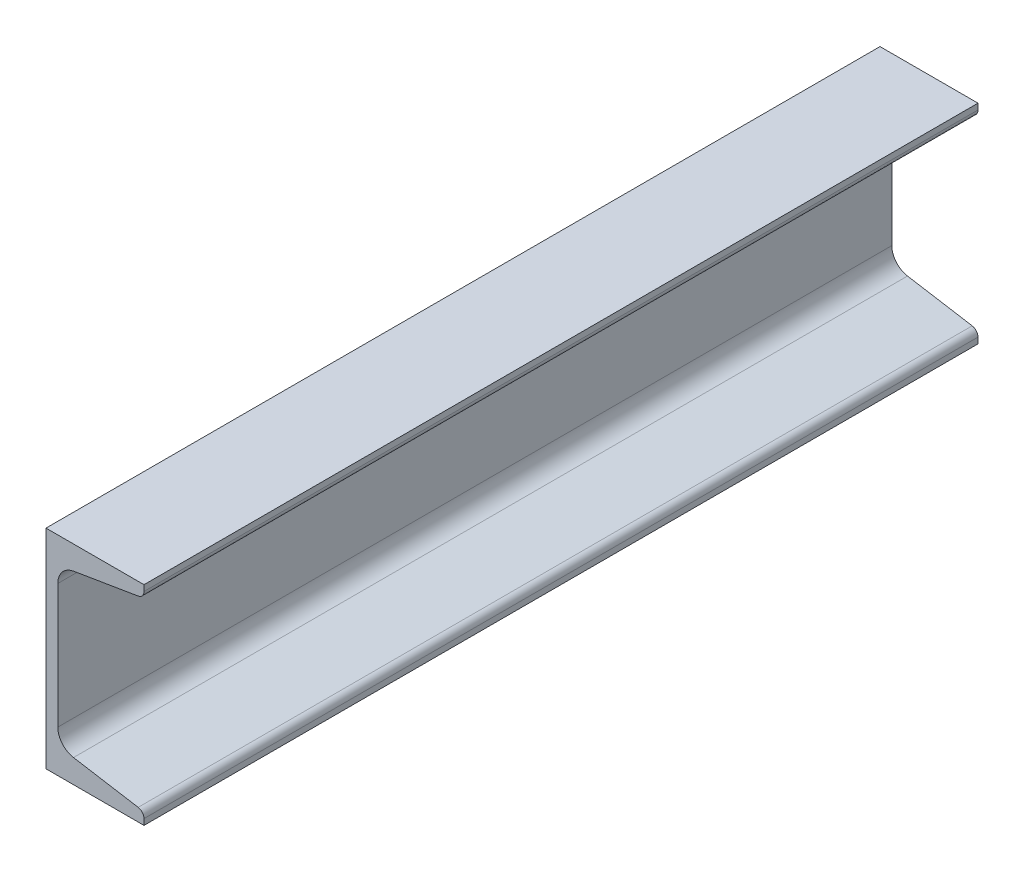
ISO-10303-21;
HEADER;
FILE_DESCRIPTION(('STEP AP214'),'2;1');
FILE_NAME('part.step','',(''),(''),'','','');
FILE_SCHEMA(('AUTOMOTIVE_DESIGN { 1 0 10303 214 1 1 1 1 }'));
ENDSEC;
DATA;
#1=APPLICATION_CONTEXT('core data for automotive mechanical design processes');
#2=APPLICATION_PROTOCOL_DEFINITION('international standard','automotive_design',2000,#1);
#3=PRODUCT_CONTEXT('',#1,'mechanical');
#4=PRODUCT('Part','Part','',(#3));
#5=PRODUCT_RELATED_PRODUCT_CATEGORY('part','',(#4));
#6=PRODUCT_DEFINITION_FORMATION('','',#4);
#7=PRODUCT_DEFINITION_CONTEXT('part definition',#1,'design');
#8=PRODUCT_DEFINITION('design','',#6,#7);
#9=PRODUCT_DEFINITION_SHAPE('','',#8);
#10=(LENGTH_UNIT() NAMED_UNIT(*) SI_UNIT(.MILLI.,.METRE.));
#11=(NAMED_UNIT(*) PLANE_ANGLE_UNIT() SI_UNIT($,.RADIAN.));
#12=(NAMED_UNIT(*) SI_UNIT($,.STERADIAN.) SOLID_ANGLE_UNIT());
#13=UNCERTAINTY_MEASURE_WITH_UNIT(LENGTH_MEASURE(1.E-05),#10,'distance_accuracy_value','');
#14=(GEOMETRIC_REPRESENTATION_CONTEXT(3) GLOBAL_UNCERTAINTY_ASSIGNED_CONTEXT((#13)) GLOBAL_UNIT_ASSIGNED_CONTEXT((#10,
#11,#12)) REPRESENTATION_CONTEXT('',''));
#15=CARTESIAN_POINT('',(0.,0.,0.));
#16=DIRECTION('',(0.,0.,1.));
#17=DIRECTION('',(1.,0.,0.));
#18=AXIS2_PLACEMENT_3D('',#15,#16,#17);
#19=CARTESIAN_POINT('',(0.,0.,152.4));
#20=DIRECTION('',(0.,1.,0.));
#21=DIRECTION('',(-1.,0.,0.));
#22=AXIS2_PLACEMENT_3D('',#19,#20,#21);
#23=PLANE('',#22);
#24=DIRECTION('',(1.,0.,0.));
#25=VECTOR('',#24,1.);
#26=CARTESIAN_POINT('',(0.,0.,-152.4));
#27=LINE('',#26,#25);
#28=CARTESIAN_POINT('',(0.,0.,-152.4));
#29=VERTEX_POINT('',#28);
#30=CARTESIAN_POINT('',(35.814,0.,-152.4));
#31=VERTEX_POINT('',#30);
#32=EDGE_CURVE('E154',#29,#31,#27,.T.);
#33=ORIENTED_EDGE('',*,*,#32,.T.);
#34=DIRECTION('',(0.,0.,-1.));
#35=VECTOR('',#34,1.);
#36=CARTESIAN_POINT('',(35.814,0.,152.4));
#37=LINE('',#36,#35);
#38=CARTESIAN_POINT('',(35.814,0.,152.4));
#39=VERTEX_POINT('',#38);
#40=EDGE_CURVE('E11',#39,#31,#37,.T.);
#41=ORIENTED_EDGE('',*,*,#40,.F.);
#42=DIRECTION('',(1.,0.,0.));
#43=VECTOR('',#42,1.);
#44=CARTESIAN_POINT('',(0.,0.,152.4));
#45=LINE('',#44,#43);
#46=CARTESIAN_POINT('',(0.,0.,152.4));
#47=VERTEX_POINT('',#46);
#48=EDGE_CURVE('E184',#47,#39,#45,.T.);
#49=ORIENTED_EDGE('',*,*,#48,.F.);
#50=DIRECTION('',(0.,0.,-1.));
#51=VECTOR('',#50,1.);
#52=CARTESIAN_POINT('',(0.,0.,152.4));
#53=LINE('',#52,#51);
#54=EDGE_CURVE('E50',#47,#29,#53,.T.);
#55=ORIENTED_EDGE('',*,*,#54,.T.);
#56=EDGE_LOOP('',(#33,#41,#49,#55));
#57=FACE_BOUND('',#56,.T.);
#58=ADVANCED_FACE('F34',(#57),#23,.F.);
#59=CARTESIAN_POINT('',(35.814,0.,152.4));
#60=DIRECTION('',(-1.,0.,0.));
#61=DIRECTION('',(0.,-1.,0.));
#62=AXIS2_PLACEMENT_3D('',#59,#60,#61);
#63=PLANE('',#62);
#64=DIRECTION('',(0.,1.,0.));
#65=VECTOR('',#64,1.);
#66=CARTESIAN_POINT('',(35.814,0.,-152.4));
#67=LINE('',#66,#65);
#68=CARTESIAN_POINT('',(35.814,2.15646,-152.4));
#69=VERTEX_POINT('',#68);
#70=EDGE_CURVE('E156',#31,#69,#67,.T.);
#71=ORIENTED_EDGE('',*,*,#70,.T.);
#72=DIRECTION('',(0.,0.,-1.));
#73=VECTOR('',#72,1.);
#74=CARTESIAN_POINT('',(35.814,2.15646,152.4));
#75=LINE('',#74,#73);
#76=CARTESIAN_POINT('',(35.814,2.15646,152.4));
#77=VERTEX_POINT('',#76);
#78=EDGE_CURVE('E42',#77,#69,#75,.T.);
#79=ORIENTED_EDGE('',*,*,#78,.F.);
#80=DIRECTION('',(0.,1.,0.));
#81=VECTOR('',#80,1.);
#82=CARTESIAN_POINT('',(35.814,0.,152.4));
#83=LINE('',#82,#81);
#84=EDGE_CURVE('E100',#39,#77,#83,.T.);
#85=ORIENTED_EDGE('',*,*,#84,.F.);
#86=ORIENTED_EDGE('',*,*,#40,.T.);
#87=EDGE_LOOP('',(#71,#79,#85,#86));
#88=FACE_BOUND('',#87,.T.);
#89=ADVANCED_FACE('F246',(#88),#63,.F.);
#90=CARTESIAN_POINT('',(33.274,2.15646,152.4));
#91=DIRECTION('',(0.,0.,-1.));
#92=DIRECTION('',(-1.,0.,0.));
#93=AXIS2_PLACEMENT_3D('',#90,#91,#92);
#94=CYLINDRICAL_SURFACE('',#93,2.54);
#95=CARTESIAN_POINT('',(33.274,2.15646,-152.4));
#96=DIRECTION('',(0.,0.,1.));
#97=DIRECTION('',(1.,0.,0.));
#98=AXIS2_PLACEMENT_3D('',#95,#96,#97);
#99=CIRCLE('',#98,2.54);
#100=CARTESIAN_POINT('',(33.6916030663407,4.66189562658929,-152.4));
#101=VERTEX_POINT('',#100);
#102=EDGE_CURVE('E158',#69,#101,#99,.T.);
#103=ORIENTED_EDGE('',*,*,#102,.T.);
#104=DIRECTION('',(0.,0.,-1.));
#105=VECTOR('',#104,1.);
#106=CARTESIAN_POINT('',(33.6916030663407,4.66189562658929,152.4));
#107=LINE('',#106,#105);
#108=CARTESIAN_POINT('',(33.6916030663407,4.66189562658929,152.4));
#109=VERTEX_POINT('',#108);
#110=EDGE_CURVE('E199',#109,#101,#107,.T.);
#111=ORIENTED_EDGE('',*,*,#110,.F.);
#112=CARTESIAN_POINT('',(33.274,2.15646,152.4));
#113=DIRECTION('',(0.,0.,1.));
#114=DIRECTION('',(1.,0.,0.));
#115=AXIS2_PLACEMENT_3D('',#112,#113,#114);
#116=CIRCLE('',#115,2.54);
#117=EDGE_CURVE('E206',#77,#109,#116,.T.);
#118=ORIENTED_EDGE('',*,*,#117,.F.);
#119=ORIENTED_EDGE('',*,*,#78,.T.);
#120=EDGE_LOOP('',(#103,#111,#118,#119));
#121=FACE_BOUND('',#120,.T.);
#122=ADVANCED_FACE('F204',(#121),#94,.T.);
#123=CARTESIAN_POINT('',(10.0484717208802,8.60270497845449,152.4));
#124=DIRECTION('',(0.164410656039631,0.986391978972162,0.));
#125=DIRECTION('',(-0.986391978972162,0.164410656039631,0.));
#126=AXIS2_PLACEMENT_3D('',#123,#124,#125);
#127=PLANE('',#126);
#128=DIRECTION('',(0.986391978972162,-0.164410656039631,0.));
#129=VECTOR('',#128,1.);
#130=CARTESIAN_POINT('',(10.0484717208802,8.60270497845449,-152.4));
#131=LINE('',#130,#129);
#132=CARTESIAN_POINT('',(10.0484717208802,8.60270497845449,-152.4));
#133=VERTEX_POINT('',#132);
#134=EDGE_CURVE('E161',#133,#101,#131,.T.);
#135=ORIENTED_EDGE('',*,*,#134,.F.);
#136=DIRECTION('',(0.,0.,-1.));
#137=VECTOR('',#136,1.);
#138=CARTESIAN_POINT('',(10.0484717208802,8.60270497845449,152.4));
#139=LINE('',#138,#137);
#140=CARTESIAN_POINT('',(10.0484717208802,8.60270497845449,152.4));
#141=VERTEX_POINT('',#140);
#142=EDGE_CURVE('E197',#141,#133,#139,.T.);
#143=ORIENTED_EDGE('',*,*,#142,.F.);
#144=DIRECTION('',(0.986391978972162,-0.164410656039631,0.));
#145=VECTOR('',#144,1.);
#146=CARTESIAN_POINT('',(10.0484717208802,8.60270497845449,152.4));
#147=LINE('',#146,#145);
#148=EDGE_CURVE('E215',#141,#109,#147,.T.);
#149=ORIENTED_EDGE('',*,*,#148,.T.);
#150=ORIENTED_EDGE('',*,*,#110,.T.);
#151=EDGE_LOOP('',(#135,#143,#149,#150));
#152=FACE_BOUND('',#151,.T.);
#153=ADVANCED_FACE('F212',(#152),#127,.T.);
#154=CARTESIAN_POINT('',(11.176,15.3673811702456,152.4));
#155=DIRECTION('',(0.,0.,-1.));
#156=DIRECTION('',(-1.,0.,0.));
#157=AXIS2_PLACEMENT_3D('',#154,#155,#156);
#158=CYLINDRICAL_SURFACE('',#157,6.858);
#159=CARTESIAN_POINT('',(11.176,15.3673811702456,-152.4));
#160=DIRECTION('',(0.,0.,1.));
#161=DIRECTION('',(1.,0.,0.));
#162=AXIS2_PLACEMENT_3D('',#159,#160,#161);
#163=CIRCLE('',#162,6.858);
#164=CARTESIAN_POINT('',(4.318,15.3673811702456,-152.4));
#165=VERTEX_POINT('',#164);
#166=EDGE_CURVE('E164',#165,#133,#163,.T.);
#167=ORIENTED_EDGE('',*,*,#166,.F.);
#168=DIRECTION('',(0.,0.,-1.));
#169=VECTOR('',#168,1.);
#170=CARTESIAN_POINT('',(4.318,15.3673811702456,152.4));
#171=LINE('',#170,#169);
#172=CARTESIAN_POINT('',(4.318,15.3673811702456,152.4));
#173=VERTEX_POINT('',#172);
#174=EDGE_CURVE('E195',#173,#165,#171,.T.);
#175=ORIENTED_EDGE('',*,*,#174,.F.);
#176=CARTESIAN_POINT('',(11.176,15.3673811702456,152.4));
#177=DIRECTION('',(0.,0.,1.));
#178=DIRECTION('',(1.,0.,0.));
#179=AXIS2_PLACEMENT_3D('',#176,#177,#178);
#180=CIRCLE('',#179,6.858);
#181=EDGE_CURVE('E218',#173,#141,#180,.T.);
#182=ORIENTED_EDGE('',*,*,#181,.T.);
#183=ORIENTED_EDGE('',*,*,#142,.T.);
#184=EDGE_LOOP('',(#167,#175,#182,#183));
#185=FACE_BOUND('',#184,.T.);
#186=ADVANCED_FACE('F259',(#185),#158,.F.);
#187=CARTESIAN_POINT('',(4.318,60.8326188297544,152.4));
#188=DIRECTION('',(1.,0.,0.));
#189=DIRECTION('',(0.,1.,0.));
#190=AXIS2_PLACEMENT_3D('',#187,#188,#189);
#191=PLANE('',#190);
#192=DIRECTION('',(0.,-1.,0.));
#193=VECTOR('',#192,1.);
#194=CARTESIAN_POINT('',(4.318,60.8326188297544,-152.4));
#195=LINE('',#194,#193);
#196=CARTESIAN_POINT('',(4.318,60.8326188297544,-152.4));
#197=VERTEX_POINT('',#196);
#198=EDGE_CURVE('E167',#197,#165,#195,.T.);
#199=ORIENTED_EDGE('',*,*,#198,.F.);
#200=DIRECTION('',(0.,0.,-1.));
#201=VECTOR('',#200,1.);
#202=CARTESIAN_POINT('',(4.318,60.8326188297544,152.4));
#203=LINE('',#202,#201);
#204=CARTESIAN_POINT('',(4.318,60.8326188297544,152.4));
#205=VERTEX_POINT('',#204);
#206=EDGE_CURVE('E193',#205,#197,#203,.T.);
#207=ORIENTED_EDGE('',*,*,#206,.F.);
#208=DIRECTION('',(0.,-1.,0.));
#209=VECTOR('',#208,1.);
#210=CARTESIAN_POINT('',(4.318,60.8326188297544,152.4));
#211=LINE('',#210,#209);
#212=EDGE_CURVE('E220',#205,#173,#211,.T.);
#213=ORIENTED_EDGE('',*,*,#212,.T.);
#214=ORIENTED_EDGE('',*,*,#174,.T.);
#215=EDGE_LOOP('',(#199,#207,#213,#214));
#216=FACE_BOUND('',#215,.T.);
#217=ADVANCED_FACE('F262',(#216),#191,.T.);
#218=CARTESIAN_POINT('',(11.176,60.8326188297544,152.4));
#219=DIRECTION('',(0.,0.,-1.));
#220=DIRECTION('',(-1.,0.,0.));
#221=AXIS2_PLACEMENT_3D('',#218,#219,#220);
#222=CYLINDRICAL_SURFACE('',#221,6.85799999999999);
#223=CARTESIAN_POINT('',(11.176,60.8326188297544,-152.4));
#224=DIRECTION('',(0.,0.,-1.));
#225=DIRECTION('',(-1.,0.,0.));
#226=AXIS2_PLACEMENT_3D('',#223,#224,#225);
#227=CIRCLE('',#226,6.85799999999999);
#228=CARTESIAN_POINT('',(10.0484717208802,67.5972950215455,-152.4));
#229=VERTEX_POINT('',#228);
#230=EDGE_CURVE('E170',#197,#229,#227,.T.);
#231=ORIENTED_EDGE('',*,*,#230,.T.);
#232=DIRECTION('',(0.,0.,-1.));
#233=VECTOR('',#232,1.);
#234=CARTESIAN_POINT('',(10.0484717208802,67.5972950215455,152.4));
#235=LINE('',#234,#233);
#236=CARTESIAN_POINT('',(10.0484717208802,67.5972950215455,152.4));
#237=VERTEX_POINT('',#236);
#238=EDGE_CURVE('E190',#237,#229,#235,.T.);
#239=ORIENTED_EDGE('',*,*,#238,.F.);
#240=CARTESIAN_POINT('',(11.176,60.8326188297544,152.4));
#241=DIRECTION('',(0.,0.,-1.));
#242=DIRECTION('',(-1.,0.,0.));
#243=AXIS2_PLACEMENT_3D('',#240,#241,#242);
#244=CIRCLE('',#243,6.85799999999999);
#245=EDGE_CURVE('E227',#205,#237,#244,.T.);
#246=ORIENTED_EDGE('',*,*,#245,.F.);
#247=ORIENTED_EDGE('',*,*,#206,.T.);
#248=EDGE_LOOP('',(#231,#239,#246,#247));
#249=FACE_BOUND('',#248,.T.);
#250=ADVANCED_FACE('F266',(#249),#222,.F.);
#251=CARTESIAN_POINT('',(10.0484717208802,67.5972950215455,152.4));
#252=DIRECTION('',(-0.164410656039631,0.986391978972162,0.));
#253=DIRECTION('',(-0.986391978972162,-0.164410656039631,0.));
#254=AXIS2_PLACEMENT_3D('',#251,#252,#253);
#255=PLANE('',#254);
#256=DIRECTION('',(0.986391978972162,0.164410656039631,0.));
#257=VECTOR('',#256,1.);
#258=CARTESIAN_POINT('',(10.0484717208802,67.5972950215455,-152.4));
#259=LINE('',#258,#257);
#260=CARTESIAN_POINT('',(33.6916030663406,71.5381043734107,-152.4));
#261=VERTEX_POINT('',#260);
#262=EDGE_CURVE('E172',#229,#261,#259,.T.);
#263=ORIENTED_EDGE('',*,*,#262,.T.);
#264=DIRECTION('',(0.,0.,-1.));
#265=VECTOR('',#264,1.);
#266=CARTESIAN_POINT('',(33.6916030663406,71.5381043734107,152.4));
#267=LINE('',#266,#265);
#268=CARTESIAN_POINT('',(33.6916030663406,71.5381043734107,152.4));
#269=VERTEX_POINT('',#268);
#270=EDGE_CURVE('E188',#269,#261,#267,.T.);
#271=ORIENTED_EDGE('',*,*,#270,.F.);
#272=DIRECTION('',(0.986391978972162,0.164410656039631,0.));
#273=VECTOR('',#272,1.);
#274=CARTESIAN_POINT('',(10.0484717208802,67.5972950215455,152.4));
#275=LINE('',#274,#273);
#276=EDGE_CURVE('E229',#237,#269,#275,.T.);
#277=ORIENTED_EDGE('',*,*,#276,.F.);
#278=ORIENTED_EDGE('',*,*,#238,.T.);
#279=EDGE_LOOP('',(#263,#271,#277,#278));
#280=FACE_BOUND('',#279,.T.);
#281=ADVANCED_FACE('F270',(#280),#255,.F.);
#282=CARTESIAN_POINT('',(33.274,74.04354,152.4));
#283=DIRECTION('',(0.,0.,-1.));
#284=DIRECTION('',(-1.,0.,0.));
#285=AXIS2_PLACEMENT_3D('',#282,#283,#284);
#286=CYLINDRICAL_SURFACE('',#285,2.53999999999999);
#287=CARTESIAN_POINT('',(33.274,74.04354,-152.4));
#288=DIRECTION('',(0.,0.,-1.));
#289=DIRECTION('',(-1.,0.,0.));
#290=AXIS2_PLACEMENT_3D('',#287,#288,#289);
#291=CIRCLE('',#290,2.53999999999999);
#292=CARTESIAN_POINT('',(35.814,74.04354,-152.4));
#293=VERTEX_POINT('',#292);
#294=EDGE_CURVE('E175',#293,#261,#291,.T.);
#295=ORIENTED_EDGE('',*,*,#294,.F.);
#296=DIRECTION('',(0.,0.,-1.));
#297=VECTOR('',#296,1.);
#298=CARTESIAN_POINT('',(35.814,74.04354,152.4));
#299=LINE('',#298,#297);
#300=CARTESIAN_POINT('',(35.814,74.04354,152.4));
#301=VERTEX_POINT('',#300);
#302=EDGE_CURVE('E137',#301,#293,#299,.T.);
#303=ORIENTED_EDGE('',*,*,#302,.F.);
#304=CARTESIAN_POINT('',(33.274,74.04354,152.4));
#305=DIRECTION('',(0.,0.,-1.));
#306=DIRECTION('',(-1.,0.,0.));
#307=AXIS2_PLACEMENT_3D('',#304,#305,#306);
#308=CIRCLE('',#307,2.53999999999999);
#309=EDGE_CURVE('E146',#301,#269,#308,.T.);
#310=ORIENTED_EDGE('',*,*,#309,.T.);
#311=ORIENTED_EDGE('',*,*,#270,.T.);
#312=EDGE_LOOP('',(#295,#303,#310,#311));
#313=FACE_BOUND('',#312,.T.);
#314=ADVANCED_FACE('F232',(#313),#286,.T.);
#315=CARTESIAN_POINT('',(35.814,76.2,152.4));
#316=DIRECTION('',(1.,0.,0.));
#317=DIRECTION('',(0.,1.,0.));
#318=AXIS2_PLACEMENT_3D('',#315,#316,#317);
#319=PLANE('',#318);
#320=DIRECTION('',(0.,-1.,0.));
#321=VECTOR('',#320,1.);
#322=CARTESIAN_POINT('',(35.814,76.2,-152.4));
#323=LINE('',#322,#321);
#324=CARTESIAN_POINT('',(35.814,76.2,-152.4));
#325=VERTEX_POINT('',#324);
#326=EDGE_CURVE('E133',#325,#293,#323,.T.);
#327=ORIENTED_EDGE('',*,*,#326,.F.);
#328=DIRECTION('',(0.,0.,-1.));
#329=VECTOR('',#328,1.);
#330=CARTESIAN_POINT('',(35.814,76.2,152.4));
#331=LINE('',#330,#329);
#332=CARTESIAN_POINT('',(35.814,76.2,152.4));
#333=VERTEX_POINT('',#332);
#334=EDGE_CURVE('E128',#333,#325,#331,.T.);
#335=ORIENTED_EDGE('',*,*,#334,.F.);
#336=DIRECTION('',(0.,-1.,0.));
#337=VECTOR('',#336,1.);
#338=CARTESIAN_POINT('',(35.814,76.2,152.4));
#339=LINE('',#338,#337);
#340=EDGE_CURVE('E131',#333,#301,#339,.T.);
#341=ORIENTED_EDGE('',*,*,#340,.T.);
#342=ORIENTED_EDGE('',*,*,#302,.T.);
#343=EDGE_LOOP('',(#327,#335,#341,#342));
#344=FACE_BOUND('',#343,.T.);
#345=ADVANCED_FACE('F130',(#344),#319,.T.);
#346=CARTESIAN_POINT('',(0.,76.2,152.4));
#347=DIRECTION('',(0.,1.,0.));
#348=DIRECTION('',(0.,0.,1.));
#349=AXIS2_PLACEMENT_3D('',#346,#347,#348);
#350=PLANE('',#349);
#351=DIRECTION('',(1.,0.,0.));
#352=VECTOR('',#351,1.);
#353=CARTESIAN_POINT('',(0.,76.2,-152.4));
#354=LINE('',#353,#352);
#355=CARTESIAN_POINT('',(0.,76.2,-152.4));
#356=VERTEX_POINT('',#355);
#357=EDGE_CURVE('E179',#356,#325,#354,.T.);
#358=ORIENTED_EDGE('',*,*,#357,.F.);
#359=DIRECTION('',(0.,0.,-1.));
#360=VECTOR('',#359,1.);
#361=CARTESIAN_POINT('',(0.,76.2,152.4));
#362=LINE('',#361,#360);
#363=CARTESIAN_POINT('',(0.,76.2,152.4));
#364=VERTEX_POINT('',#363);
#365=EDGE_CURVE('E88',#364,#356,#362,.T.);
#366=ORIENTED_EDGE('',*,*,#365,.F.);
#367=DIRECTION('',(1.,0.,0.));
#368=VECTOR('',#367,1.);
#369=CARTESIAN_POINT('',(0.,76.2,152.4));
#370=LINE('',#369,#368);
#371=EDGE_CURVE('E144',#364,#333,#370,.T.);
#372=ORIENTED_EDGE('',*,*,#371,.T.);
#373=ORIENTED_EDGE('',*,*,#334,.T.);
#374=EDGE_LOOP('',(#358,#366,#372,#373));
#375=FACE_BOUND('',#374,.T.);
#376=ADVANCED_FACE('F148',(#375),#350,.T.);
#377=CARTESIAN_POINT('',(0.,0.,152.4));
#378=DIRECTION('',(-1.,0.,0.));
#379=DIRECTION('',(0.,-1.,0.));
#380=AXIS2_PLACEMENT_3D('',#377,#378,#379);
#381=PLANE('',#380);
#382=DIRECTION('',(0.,1.,0.));
#383=VECTOR('',#382,1.);
#384=CARTESIAN_POINT('',(0.,0.,-152.4));
#385=LINE('',#384,#383);
#386=EDGE_CURVE('E181',#29,#356,#385,.T.);
#387=ORIENTED_EDGE('',*,*,#386,.F.);
#388=ORIENTED_EDGE('',*,*,#54,.F.);
#389=DIRECTION('',(0.,1.,0.));
#390=VECTOR('',#389,1.);
#391=CARTESIAN_POINT('',(0.,0.,152.4));
#392=LINE('',#391,#390);
#393=EDGE_CURVE('E149',#47,#364,#392,.T.);
#394=ORIENTED_EDGE('',*,*,#393,.T.);
#395=ORIENTED_EDGE('',*,*,#365,.T.);
#396=EDGE_LOOP('',(#387,#388,#394,#395));
#397=FACE_BOUND('',#396,.T.);
#398=ADVANCED_FACE('F235',(#397),#381,.T.);
#399=CARTESIAN_POINT('',(33.274,2.15646,152.4));
#400=DIRECTION('',(0.,0.,1.));
#401=DIRECTION('',(1.,0.,0.));
#402=AXIS2_PLACEMENT_3D('',#399,#400,#401);
#403=PLANE('',#402);
#404=ORIENTED_EDGE('',*,*,#48,.T.);
#405=ORIENTED_EDGE('',*,*,#84,.T.);
#406=ORIENTED_EDGE('',*,*,#117,.T.);
#407=ORIENTED_EDGE('',*,*,#148,.F.);
#408=ORIENTED_EDGE('',*,*,#181,.F.);
#409=ORIENTED_EDGE('',*,*,#212,.F.);
#410=ORIENTED_EDGE('',*,*,#245,.T.);
#411=ORIENTED_EDGE('',*,*,#276,.T.);
#412=ORIENTED_EDGE('',*,*,#309,.F.);
#413=ORIENTED_EDGE('',*,*,#340,.F.);
#414=ORIENTED_EDGE('',*,*,#371,.F.);
#415=ORIENTED_EDGE('',*,*,#393,.F.);
#416=EDGE_LOOP('',(#404,#405,#406,#407,#408,#409,#410,#411,#412,#413,#414,#415));
#417=FACE_BOUND('',#416,.T.);
#418=ADVANCED_FACE('F142',(#417),#403,.T.);
#419=CARTESIAN_POINT('',(33.274,2.15646,-152.4));
#420=DIRECTION('',(0.,0.,1.));
#421=DIRECTION('',(1.,0.,0.));
#422=AXIS2_PLACEMENT_3D('',#419,#420,#421);
#423=PLANE('',#422);
#424=ORIENTED_EDGE('',*,*,#32,.F.);
#425=ORIENTED_EDGE('',*,*,#386,.T.);
#426=ORIENTED_EDGE('',*,*,#357,.T.);
#427=ORIENTED_EDGE('',*,*,#326,.T.);
#428=ORIENTED_EDGE('',*,*,#294,.T.);
#429=ORIENTED_EDGE('',*,*,#262,.F.);
#430=ORIENTED_EDGE('',*,*,#230,.F.);
#431=ORIENTED_EDGE('',*,*,#198,.T.);
#432=ORIENTED_EDGE('',*,*,#166,.T.);
#433=ORIENTED_EDGE('',*,*,#134,.T.);
#434=ORIENTED_EDGE('',*,*,#102,.F.);
#435=ORIENTED_EDGE('',*,*,#70,.F.);
#436=EDGE_LOOP('',(#424,#425,#426,#427,#428,#429,#430,#431,#432,#433,#434,#435));
#437=FACE_BOUND('',#436,.T.);
#438=ADVANCED_FACE('F208',(#437),#423,.F.);
#439=CLOSED_SHELL('',(#58,#89,#122,#153,#186,#217,#250,#281,#314,#345,#376,#398,#418,#438));
#440=MANIFOLD_SOLID_BREP('B2',#439);
#441=ADVANCED_BREP_SHAPE_REPRESENTATION('',(#18,#440),#14);
#442=SHAPE_DEFINITION_REPRESENTATION(#9,#441);
ENDSEC;
END-ISO-10303-21;
